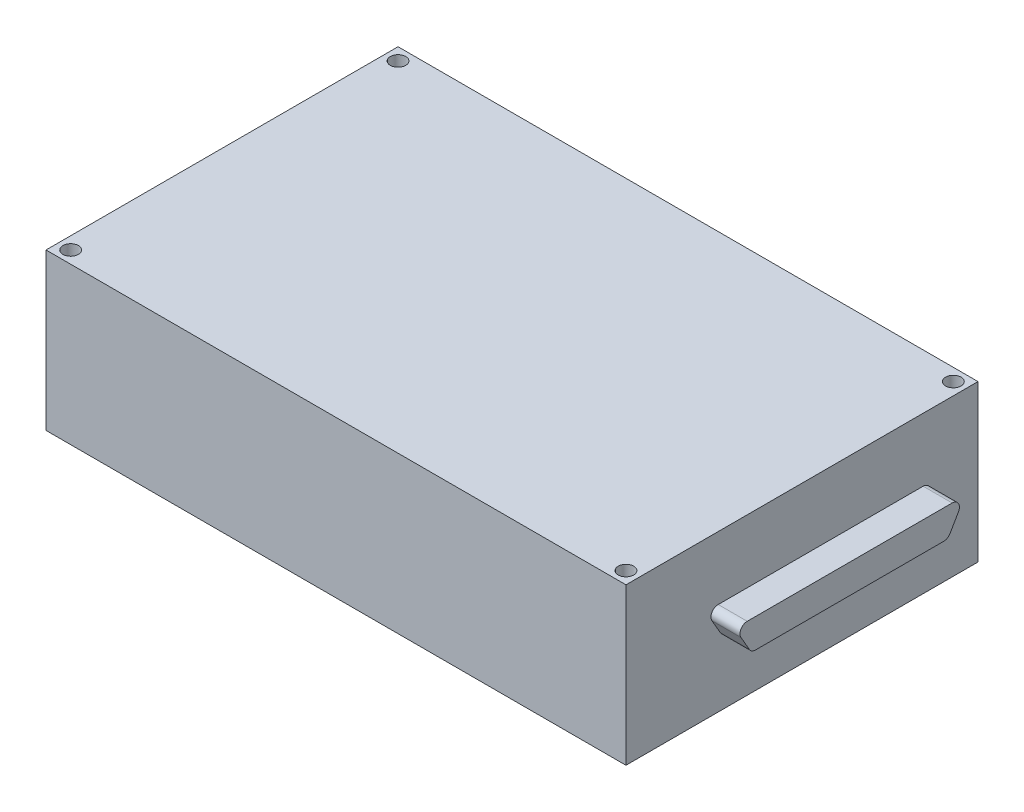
ISO-10303-21;
HEADER;
FILE_DESCRIPTION(('STEP AP214'),'2;1');
FILE_NAME('part.step','',(''),(''),'','','');
FILE_SCHEMA(('AUTOMOTIVE_DESIGN { 1 0 10303 214 1 1 1 1 }'));
ENDSEC;
DATA;
#1=APPLICATION_CONTEXT('core data for automotive mechanical design processes');
#2=APPLICATION_PROTOCOL_DEFINITION('international standard','automotive_design',2000,#1);
#3=PRODUCT_CONTEXT('',#1,'mechanical');
#4=PRODUCT('Part','Part','',(#3));
#5=PRODUCT_RELATED_PRODUCT_CATEGORY('part','',(#4));
#6=PRODUCT_DEFINITION_FORMATION('','',#4);
#7=PRODUCT_DEFINITION_CONTEXT('part definition',#1,'design');
#8=PRODUCT_DEFINITION('design','',#6,#7);
#9=PRODUCT_DEFINITION_SHAPE('','',#8);
#10=(LENGTH_UNIT() NAMED_UNIT(*) SI_UNIT(.MILLI.,.METRE.));
#11=(NAMED_UNIT(*) PLANE_ANGLE_UNIT() SI_UNIT($,.RADIAN.));
#12=(NAMED_UNIT(*) SI_UNIT($,.STERADIAN.) SOLID_ANGLE_UNIT());
#13=UNCERTAINTY_MEASURE_WITH_UNIT(LENGTH_MEASURE(1.E-05),#10,'distance_accuracy_value','');
#14=(GEOMETRIC_REPRESENTATION_CONTEXT(3) GLOBAL_UNCERTAINTY_ASSIGNED_CONTEXT((#13)) GLOBAL_UNIT_ASSIGNED_CONTEXT((#10,
#11,#12)) REPRESENTATION_CONTEXT('',''));
#15=CARTESIAN_POINT('',(0.,0.,0.));
#16=DIRECTION('',(0.,0.,1.));
#17=DIRECTION('',(1.,0.,0.));
#18=AXIS2_PLACEMENT_3D('',#15,#16,#17);
#19=CARTESIAN_POINT('',(-50.8,13.6906,30.8356));
#20=DIRECTION('',(1.,0.,0.));
#21=DIRECTION('',(0.,0.,-1.));
#22=AXIS2_PLACEMENT_3D('',#19,#20,#21);
#23=PLANE('',#22);
#24=CARTESIAN_POINT('',(-50.8,-1.9304,-12.0904));
#25=DIRECTION('',(1.,0.,0.));
#26=DIRECTION('',(0.,0.,-1.));
#27=AXIS2_PLACEMENT_3D('',#24,#25,#26);
#28=CIRCLE('',#27,5.08);
#29=CARTESIAN_POINT('',(-50.8,-1.9304,-17.1704));
#30=VERTEX_POINT('',#29);
#31=EDGE_CURVE('E49',#30,#30,#28,.F.);
#32=ORIENTED_EDGE('',*,*,#31,.F.);
#33=EDGE_LOOP('',(#32));
#34=FACE_BOUND('',#33,.T.);
#35=DIRECTION('',(0.,0.,1.));
#36=VECTOR('',#35,1.);
#37=CARTESIAN_POINT('',(-50.8,-13.6906,30.8356));
#38=LINE('',#37,#36);
#39=CARTESIAN_POINT('',(-50.8,-13.6906,-30.8356));
#40=VERTEX_POINT('',#39);
#41=CARTESIAN_POINT('',(-50.8,-13.6906,30.8356));
#42=VERTEX_POINT('',#41);
#43=EDGE_CURVE('E266',#40,#42,#38,.T.);
#44=ORIENTED_EDGE('',*,*,#43,.T.);
#45=DIRECTION('',(0.,-1.,0.));
#46=VECTOR('',#45,1.);
#47=CARTESIAN_POINT('',(-50.8,13.6906,30.8356));
#48=LINE('',#47,#46);
#49=CARTESIAN_POINT('',(-50.8,13.6906,30.8356));
#50=VERTEX_POINT('',#49);
#51=EDGE_CURVE('E274',#50,#42,#48,.T.);
#52=ORIENTED_EDGE('',*,*,#51,.F.);
#53=DIRECTION('',(0.,0.,1.));
#54=VECTOR('',#53,1.);
#55=CARTESIAN_POINT('',(-50.8,13.6906,30.8356));
#56=LINE('',#55,#54);
#57=CARTESIAN_POINT('',(-50.8,13.6906,-30.8356));
#58=VERTEX_POINT('',#57);
#59=EDGE_CURVE('E253',#58,#50,#56,.T.);
#60=ORIENTED_EDGE('',*,*,#59,.F.);
#61=DIRECTION('',(0.,-1.,0.));
#62=VECTOR('',#61,1.);
#63=CARTESIAN_POINT('',(-50.8,13.6906,-30.8356));
#64=LINE('',#63,#62);
#65=EDGE_CURVE('E278',#58,#40,#64,.T.);
#66=ORIENTED_EDGE('',*,*,#65,.T.);
#67=EDGE_LOOP('',(#44,#52,#60,#66));
#68=FACE_BOUND('',#67,.T.);
#69=CARTESIAN_POINT('',(-50.8,2.1336,22.5298));
#70=DIRECTION('',(1.,0.,0.));
#71=DIRECTION('',(0.,0.,-1.));
#72=AXIS2_PLACEMENT_3D('',#69,#70,#71);
#73=CIRCLE('',#72,1.905);
#74=CARTESIAN_POINT('',(-50.8,2.1336,20.6248));
#75=VERTEX_POINT('',#74);
#76=EDGE_CURVE('E11',#75,#75,#73,.F.);
#77=ORIENTED_EDGE('',*,*,#76,.F.);
#78=EDGE_LOOP('',(#77));
#79=FACE_BOUND('',#78,.T.);
#80=ADVANCED_FACE('F41',(#34,#68,#79),#23,.F.);
#81=CARTESIAN_POINT('',(50.8,13.6906,30.8356));
#82=DIRECTION('',(-1.,0.,0.));
#83=DIRECTION('',(0.,0.,1.));
#84=AXIS2_PLACEMENT_3D('',#81,#82,#83);
#85=PLANE('',#84);
#86=DIRECTION('',(0.,0.,-1.));
#87=VECTOR('',#86,1.);
#88=CARTESIAN_POINT('',(50.8,-13.6906,30.8356));
#89=LINE('',#88,#87);
#90=CARTESIAN_POINT('',(50.8,-13.6906,30.8356));
#91=VERTEX_POINT('',#90);
#92=CARTESIAN_POINT('',(50.8,-13.6906,-30.8356));
#93=VERTEX_POINT('',#92);
#94=EDGE_CURVE('E245',#91,#93,#89,.T.);
#95=ORIENTED_EDGE('',*,*,#94,.T.);
#96=DIRECTION('',(0.,-1.,0.));
#97=VECTOR('',#96,1.);
#98=CARTESIAN_POINT('',(50.8,13.6906,-30.8356));
#99=LINE('',#98,#97);
#100=CARTESIAN_POINT('',(50.8,13.6906,-30.8356));
#101=VERTEX_POINT('',#100);
#102=EDGE_CURVE('E282',#101,#93,#99,.T.);
#103=ORIENTED_EDGE('',*,*,#102,.F.);
#104=DIRECTION('',(0.,0.,-1.));
#105=VECTOR('',#104,1.);
#106=CARTESIAN_POINT('',(50.8,13.6906,30.8356));
#107=LINE('',#106,#105);
#108=CARTESIAN_POINT('',(50.8,13.6906,30.8356));
#109=VERTEX_POINT('',#108);
#110=EDGE_CURVE('E246',#109,#101,#107,.T.);
#111=ORIENTED_EDGE('',*,*,#110,.F.);
#112=DIRECTION('',(0.,-1.,0.));
#113=VECTOR('',#112,1.);
#114=CARTESIAN_POINT('',(50.8,13.6906,30.8356));
#115=LINE('',#114,#113);
#116=EDGE_CURVE('E259',#109,#91,#115,.T.);
#117=ORIENTED_EDGE('',*,*,#116,.T.);
#118=EDGE_LOOP('',(#95,#103,#111,#117));
#119=FACE_BOUND('',#118,.T.);
#120=CARTESIAN_POINT('',(50.8,1.34619999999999,-21.2267477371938));
#121=DIRECTION('',(1.,0.,0.));
#122=DIRECTION('',(0.,0.,1.));
#123=AXIS2_PLACEMENT_3D('',#120,#121,#122);
#124=CIRCLE('',#123,1.27);
#125=CARTESIAN_POINT('',(50.8,0.711199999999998,-22.3266));
#126=VERTEX_POINT('',#125);
#127=CARTESIAN_POINT('',(50.8,2.6162,-21.2267477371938));
#128=VERTEX_POINT('',#127);
#129=EDGE_CURVE('E185',#126,#128,#124,.T.);
#130=ORIENTED_EDGE('',*,*,#129,.F.);
#131=DIRECTION('',(0.,0.86602540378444,-0.499999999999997));
#132=VECTOR('',#131,1.);
#133=CARTESIAN_POINT('',(50.8,0.711199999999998,-22.3266));
#134=LINE('',#133,#132);
#135=CARTESIAN_POINT('',(50.8,-1.8288,-20.8601303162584));
#136=VERTEX_POINT('',#135);
#137=EDGE_CURVE('E190',#136,#126,#134,.T.);
#138=ORIENTED_EDGE('',*,*,#137,.F.);
#139=CARTESIAN_POINT('',(50.8,-1.1938,-19.7602780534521));
#140=DIRECTION('',(1.,0.,0.));
#141=DIRECTION('',(0.,0.,-1.));
#142=AXIS2_PLACEMENT_3D('',#139,#140,#141);
#143=CIRCLE('',#142,1.27);
#144=CARTESIAN_POINT('',(50.8,-2.4638,-19.7602780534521));
#145=VERTEX_POINT('',#144);
#146=EDGE_CURVE('E218',#145,#136,#143,.T.);
#147=ORIENTED_EDGE('',*,*,#146,.F.);
#148=DIRECTION('',(0.,0.,-1.));
#149=VECTOR('',#148,1.);
#150=CARTESIAN_POINT('',(50.8,-2.4638,13.2070780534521));
#151=LINE('',#150,#149);
#152=CARTESIAN_POINT('',(50.8,-2.4638,13.2070780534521));
#153=VERTEX_POINT('',#152);
#154=EDGE_CURVE('E215',#153,#145,#151,.T.);
#155=ORIENTED_EDGE('',*,*,#154,.F.);
#156=CARTESIAN_POINT('',(50.8,-1.1938,13.2070780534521));
#157=DIRECTION('',(1.,0.,0.));
#158=DIRECTION('',(0.,0.,-1.));
#159=AXIS2_PLACEMENT_3D('',#156,#157,#158);
#160=CIRCLE('',#159,1.27);
#161=CARTESIAN_POINT('',(50.8,-1.8288,14.3069303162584));
#162=VERTEX_POINT('',#161);
#163=EDGE_CURVE('E212',#162,#153,#160,.T.);
#164=ORIENTED_EDGE('',*,*,#163,.F.);
#165=DIRECTION('',(0.,-0.86602540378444,-0.499999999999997));
#166=VECTOR('',#165,1.);
#167=CARTESIAN_POINT('',(50.8,0.711199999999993,15.7734));
#168=LINE('',#167,#166);
#169=CARTESIAN_POINT('',(50.8,0.711199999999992,15.7734));
#170=VERTEX_POINT('',#169);
#171=EDGE_CURVE('E209',#170,#162,#168,.T.);
#172=ORIENTED_EDGE('',*,*,#171,.F.);
#173=CARTESIAN_POINT('',(50.8,1.34619999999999,14.6735477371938));
#174=DIRECTION('',(1.,0.,0.));
#175=DIRECTION('',(0.,0.,1.));
#176=AXIS2_PLACEMENT_3D('',#173,#174,#175);
#177=CIRCLE('',#176,1.27);
#178=CARTESIAN_POINT('',(50.8,2.61619999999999,14.6735477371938));
#179=VERTEX_POINT('',#178);
#180=EDGE_CURVE('E61',#179,#170,#177,.T.);
#181=ORIENTED_EDGE('',*,*,#180,.F.);
#182=DIRECTION('',(0.,0.,1.));
#183=VECTOR('',#182,1.);
#184=CARTESIAN_POINT('',(50.8,2.6162,14.6735477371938));
#185=LINE('',#184,#183);
#186=EDGE_CURVE('E56',#128,#179,#185,.T.);
#187=ORIENTED_EDGE('',*,*,#186,.F.);
#188=EDGE_LOOP('',(#130,#138,#147,#155,#164,#172,#181,#187));
#189=FACE_BOUND('',#188,.T.);
#190=ADVANCED_FACE('F43',(#119,#189),#85,.F.);
#191=CARTESIAN_POINT('',(-50.8,13.6906,-30.8356));
#192=DIRECTION('',(0.,0.,1.));
#193=DIRECTION('',(1.,0.,0.));
#194=AXIS2_PLACEMENT_3D('',#191,#192,#193);
#195=PLANE('',#194);
#196=DIRECTION('',(-1.,0.,0.));
#197=VECTOR('',#196,1.);
#198=CARTESIAN_POINT('',(-50.8,-13.6906,-30.8356));
#199=LINE('',#198,#197);
#200=EDGE_CURVE('E263',#93,#40,#199,.T.);
#201=ORIENTED_EDGE('',*,*,#200,.T.);
#202=ORIENTED_EDGE('',*,*,#65,.F.);
#203=DIRECTION('',(-1.,0.,0.));
#204=VECTOR('',#203,1.);
#205=CARTESIAN_POINT('',(-50.8,13.6906,-30.8356));
#206=LINE('',#205,#204);
#207=EDGE_CURVE('E249',#101,#58,#206,.T.);
#208=ORIENTED_EDGE('',*,*,#207,.F.);
#209=ORIENTED_EDGE('',*,*,#102,.T.);
#210=EDGE_LOOP('',(#201,#202,#208,#209));
#211=FACE_BOUND('',#210,.T.);
#212=ADVANCED_FACE('F366',(#211),#195,.F.);
#213=CARTESIAN_POINT('',(-50.8,13.6906,30.8356));
#214=DIRECTION('',(0.,0.,-1.));
#215=DIRECTION('',(-1.,0.,0.));
#216=AXIS2_PLACEMENT_3D('',#213,#214,#215);
#217=PLANE('',#216);
#218=DIRECTION('',(1.,0.,0.));
#219=VECTOR('',#218,1.);
#220=CARTESIAN_POINT('',(-50.8,-13.6906,30.8356));
#221=LINE('',#220,#219);
#222=EDGE_CURVE('E250',#42,#91,#221,.T.);
#223=ORIENTED_EDGE('',*,*,#222,.T.);
#224=ORIENTED_EDGE('',*,*,#116,.F.);
#225=DIRECTION('',(1.,0.,0.));
#226=VECTOR('',#225,1.);
#227=CARTESIAN_POINT('',(-50.8,13.6906,30.8356));
#228=LINE('',#227,#226);
#229=EDGE_CURVE('E256',#50,#109,#228,.T.);
#230=ORIENTED_EDGE('',*,*,#229,.F.);
#231=ORIENTED_EDGE('',*,*,#51,.T.);
#232=EDGE_LOOP('',(#223,#224,#230,#231));
#233=FACE_BOUND('',#232,.T.);
#234=ADVANCED_FACE('F360',(#233),#217,.F.);
#235=CARTESIAN_POINT('',(0.,13.6906,0.));
#236=DIRECTION('',(0.,-1.,0.));
#237=DIRECTION('',(0.,0.,-1.));
#238=AXIS2_PLACEMENT_3D('',#235,#236,#237);
#239=PLANE('',#238);
#240=CARTESIAN_POINT('',(48.641,13.6906,28.6766));
#241=DIRECTION('',(0.,1.,0.));
#242=DIRECTION('',(0.,0.,1.));
#243=AXIS2_PLACEMENT_3D('',#240,#241,#242);
#244=CIRCLE('',#243,1.35254999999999);
#245=CARTESIAN_POINT('',(48.641,13.6906,30.02915));
#246=VERTEX_POINT('',#245);
#247=EDGE_CURVE('E153',#246,#246,#244,.T.);
#248=ORIENTED_EDGE('',*,*,#247,.F.);
#249=EDGE_LOOP('',(#248));
#250=FACE_BOUND('',#249,.T.);
#251=CARTESIAN_POINT('',(-48.641,13.6906,-28.6766));
#252=DIRECTION('',(0.,1.,0.));
#253=DIRECTION('',(0.,0.,1.));
#254=AXIS2_PLACEMENT_3D('',#251,#252,#253);
#255=CIRCLE('',#254,1.35254999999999);
#256=CARTESIAN_POINT('',(-48.641,13.6906,-27.32405));
#257=VERTEX_POINT('',#256);
#258=EDGE_CURVE('E152',#257,#257,#255,.T.);
#259=ORIENTED_EDGE('',*,*,#258,.F.);
#260=EDGE_LOOP('',(#259));
#261=FACE_BOUND('',#260,.T.);
#262=CARTESIAN_POINT('',(48.641,13.6906,-28.6766));
#263=DIRECTION('',(0.,1.,0.));
#264=DIRECTION('',(0.,0.,1.));
#265=AXIS2_PLACEMENT_3D('',#262,#263,#264);
#266=CIRCLE('',#265,1.35254999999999);
#267=CARTESIAN_POINT('',(48.641,13.6906,-27.32405));
#268=VERTEX_POINT('',#267);
#269=EDGE_CURVE('E165',#268,#268,#266,.T.);
#270=ORIENTED_EDGE('',*,*,#269,.F.);
#271=EDGE_LOOP('',(#270));
#272=FACE_BOUND('',#271,.T.);
#273=CARTESIAN_POINT('',(-48.641,13.6906,28.6766));
#274=DIRECTION('',(0.,1.,0.));
#275=DIRECTION('',(0.,0.,1.));
#276=AXIS2_PLACEMENT_3D('',#273,#274,#275);
#277=CIRCLE('',#276,1.35254999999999);
#278=CARTESIAN_POINT('',(-48.641,13.6906,30.02915));
#279=VERTEX_POINT('',#278);
#280=EDGE_CURVE('E171',#279,#279,#277,.T.);
#281=ORIENTED_EDGE('',*,*,#280,.F.);
#282=EDGE_LOOP('',(#281));
#283=FACE_BOUND('',#282,.T.);
#284=ORIENTED_EDGE('',*,*,#110,.T.);
#285=ORIENTED_EDGE('',*,*,#207,.T.);
#286=ORIENTED_EDGE('',*,*,#59,.T.);
#287=ORIENTED_EDGE('',*,*,#229,.T.);
#288=EDGE_LOOP('',(#284,#285,#286,#287));
#289=FACE_BOUND('',#288,.T.);
#290=ADVANCED_FACE('F357',(#250,#261,#272,#283,#289),#239,.F.);
#291=CARTESIAN_POINT('',(0.,-13.6906,0.));
#292=DIRECTION('',(0.,-1.,0.));
#293=DIRECTION('',(0.,0.,-1.));
#294=AXIS2_PLACEMENT_3D('',#291,#292,#293);
#295=PLANE('',#294);
#296=ORIENTED_EDGE('',*,*,#94,.F.);
#297=ORIENTED_EDGE('',*,*,#222,.F.);
#298=ORIENTED_EDGE('',*,*,#43,.F.);
#299=ORIENTED_EDGE('',*,*,#200,.F.);
#300=EDGE_LOOP('',(#296,#297,#298,#299));
#301=FACE_BOUND('',#300,.T.);
#302=ADVANCED_FACE('F355',(#301),#295,.T.);
#303=CARTESIAN_POINT('',(55.88,1.34619999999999,-21.2267477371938));
#304=DIRECTION('',(-1.,0.,0.));
#305=DIRECTION('',(0.,0.,1.));
#306=AXIS2_PLACEMENT_3D('',#303,#304,#305);
#307=CYLINDRICAL_SURFACE('',#306,1.27);
#308=ORIENTED_EDGE('',*,*,#129,.T.);
#309=DIRECTION('',(-1.,0.,0.));
#310=VECTOR('',#309,1.);
#311=CARTESIAN_POINT('',(55.88,2.6162,-21.2267477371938));
#312=LINE('',#311,#310);
#313=CARTESIAN_POINT('',(55.88,2.6162,-21.2267477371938));
#314=VERTEX_POINT('',#313);
#315=EDGE_CURVE('E243',#314,#128,#312,.T.);
#316=ORIENTED_EDGE('',*,*,#315,.F.);
#317=CARTESIAN_POINT('',(55.88,1.34619999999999,-21.2267477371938));
#318=DIRECTION('',(1.,0.,0.));
#319=DIRECTION('',(0.,0.,1.));
#320=AXIS2_PLACEMENT_3D('',#317,#318,#319);
#321=CIRCLE('',#320,1.27);
#322=CARTESIAN_POINT('',(55.88,0.711199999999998,-22.3266));
#323=VERTEX_POINT('',#322);
#324=EDGE_CURVE('E186',#323,#314,#321,.T.);
#325=ORIENTED_EDGE('',*,*,#324,.F.);
#326=DIRECTION('',(-1.,0.,0.));
#327=VECTOR('',#326,1.);
#328=CARTESIAN_POINT('',(55.88,0.711199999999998,-22.3266));
#329=LINE('',#328,#327);
#330=EDGE_CURVE('E204',#323,#126,#329,.T.);
#331=ORIENTED_EDGE('',*,*,#330,.T.);
#332=EDGE_LOOP('',(#308,#316,#325,#331));
#333=FACE_BOUND('',#332,.T.);
#334=ADVANCED_FACE('F351',(#333),#307,.T.);
#335=CARTESIAN_POINT('',(55.88,2.6162,14.6735477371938));
#336=DIRECTION('',(0.,-1.,0.));
#337=DIRECTION('',(0.,0.,-1.));
#338=AXIS2_PLACEMENT_3D('',#335,#336,#337);
#339=PLANE('',#338);
#340=ORIENTED_EDGE('',*,*,#186,.T.);
#341=DIRECTION('',(-1.,0.,0.));
#342=VECTOR('',#341,1.);
#343=CARTESIAN_POINT('',(55.88,2.6162,14.6735477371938));
#344=LINE('',#343,#342);
#345=CARTESIAN_POINT('',(55.88,2.6162,14.6735477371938));
#346=VERTEX_POINT('',#345);
#347=EDGE_CURVE('E240',#346,#179,#344,.T.);
#348=ORIENTED_EDGE('',*,*,#347,.F.);
#349=DIRECTION('',(0.,0.,1.));
#350=VECTOR('',#349,1.);
#351=CARTESIAN_POINT('',(55.88,2.6162,14.6735477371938));
#352=LINE('',#351,#350);
#353=EDGE_CURVE('E189',#314,#346,#352,.T.);
#354=ORIENTED_EDGE('',*,*,#353,.F.);
#355=ORIENTED_EDGE('',*,*,#315,.T.);
#356=EDGE_LOOP('',(#340,#348,#354,#355));
#357=FACE_BOUND('',#356,.T.);
#358=ADVANCED_FACE('F347',(#357),#339,.F.);
#359=CARTESIAN_POINT('',(55.88,1.34619999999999,14.6735477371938));
#360=DIRECTION('',(-1.,0.,0.));
#361=DIRECTION('',(0.,0.,1.));
#362=AXIS2_PLACEMENT_3D('',#359,#360,#361);
#363=CYLINDRICAL_SURFACE('',#362,1.27);
#364=ORIENTED_EDGE('',*,*,#180,.T.);
#365=DIRECTION('',(-1.,0.,0.));
#366=VECTOR('',#365,1.);
#367=CARTESIAN_POINT('',(55.88,0.711199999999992,15.7734));
#368=LINE('',#367,#366);
#369=CARTESIAN_POINT('',(55.88,0.711199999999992,15.7734));
#370=VERTEX_POINT('',#369);
#371=EDGE_CURVE('E237',#370,#170,#368,.T.);
#372=ORIENTED_EDGE('',*,*,#371,.F.);
#373=CARTESIAN_POINT('',(55.88,1.34619999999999,14.6735477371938));
#374=DIRECTION('',(1.,0.,0.));
#375=DIRECTION('',(0.,0.,1.));
#376=AXIS2_PLACEMENT_3D('',#373,#374,#375);
#377=CIRCLE('',#376,1.27);
#378=EDGE_CURVE('E192',#346,#370,#377,.T.);
#379=ORIENTED_EDGE('',*,*,#378,.F.);
#380=ORIENTED_EDGE('',*,*,#347,.T.);
#381=EDGE_LOOP('',(#364,#372,#379,#380));
#382=FACE_BOUND('',#381,.T.);
#383=ADVANCED_FACE('F343',(#382),#363,.T.);
#384=CARTESIAN_POINT('',(55.88,0.711199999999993,15.7734));
#385=DIRECTION('',(0.,0.499999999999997,-0.86602540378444));
#386=DIRECTION('',(0.,0.86602540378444,0.499999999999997));
#387=AXIS2_PLACEMENT_3D('',#384,#385,#386);
#388=PLANE('',#387);
#389=ORIENTED_EDGE('',*,*,#171,.T.);
#390=DIRECTION('',(-1.,0.,0.));
#391=VECTOR('',#390,1.);
#392=CARTESIAN_POINT('',(55.88,-1.8288,14.3069303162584));
#393=LINE('',#392,#391);
#394=CARTESIAN_POINT('',(55.88,-1.8288,14.3069303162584));
#395=VERTEX_POINT('',#394);
#396=EDGE_CURVE('E234',#395,#162,#393,.T.);
#397=ORIENTED_EDGE('',*,*,#396,.F.);
#398=DIRECTION('',(0.,-0.86602540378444,-0.499999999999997));
#399=VECTOR('',#398,1.);
#400=CARTESIAN_POINT('',(55.88,0.711199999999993,15.7734));
#401=LINE('',#400,#399);
#402=EDGE_CURVE('E194',#370,#395,#401,.T.);
#403=ORIENTED_EDGE('',*,*,#402,.F.);
#404=ORIENTED_EDGE('',*,*,#371,.T.);
#405=EDGE_LOOP('',(#389,#397,#403,#404));
#406=FACE_BOUND('',#405,.T.);
#407=ADVANCED_FACE('F339',(#406),#388,.F.);
#408=CARTESIAN_POINT('',(55.88,-1.1938,13.2070780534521));
#409=DIRECTION('',(-1.,0.,0.));
#410=DIRECTION('',(0.,0.,1.));
#411=AXIS2_PLACEMENT_3D('',#408,#409,#410);
#412=CYLINDRICAL_SURFACE('',#411,1.27);
#413=ORIENTED_EDGE('',*,*,#163,.T.);
#414=DIRECTION('',(-1.,0.,0.));
#415=VECTOR('',#414,1.);
#416=CARTESIAN_POINT('',(55.88,-2.4638,13.2070780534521));
#417=LINE('',#416,#415);
#418=CARTESIAN_POINT('',(55.88,-2.4638,13.2070780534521));
#419=VERTEX_POINT('',#418);
#420=EDGE_CURVE('E231',#419,#153,#417,.T.);
#421=ORIENTED_EDGE('',*,*,#420,.F.);
#422=CARTESIAN_POINT('',(55.88,-1.1938,13.2070780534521));
#423=DIRECTION('',(1.,0.,0.));
#424=DIRECTION('',(0.,0.,-1.));
#425=AXIS2_PLACEMENT_3D('',#422,#423,#424);
#426=CIRCLE('',#425,1.27);
#427=EDGE_CURVE('E196',#395,#419,#426,.T.);
#428=ORIENTED_EDGE('',*,*,#427,.F.);
#429=ORIENTED_EDGE('',*,*,#396,.T.);
#430=EDGE_LOOP('',(#413,#421,#428,#429));
#431=FACE_BOUND('',#430,.T.);
#432=ADVANCED_FACE('F335',(#431),#412,.T.);
#433=CARTESIAN_POINT('',(55.88,-2.4638,13.2070780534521));
#434=DIRECTION('',(0.,1.,0.));
#435=DIRECTION('',(0.,0.,1.));
#436=AXIS2_PLACEMENT_3D('',#433,#434,#435);
#437=PLANE('',#436);
#438=ORIENTED_EDGE('',*,*,#154,.T.);
#439=DIRECTION('',(-1.,0.,0.));
#440=VECTOR('',#439,1.);
#441=CARTESIAN_POINT('',(55.88,-2.4638,-19.7602780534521));
#442=LINE('',#441,#440);
#443=CARTESIAN_POINT('',(55.88,-2.4638,-19.7602780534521));
#444=VERTEX_POINT('',#443);
#445=EDGE_CURVE('E228',#444,#145,#442,.T.);
#446=ORIENTED_EDGE('',*,*,#445,.F.);
#447=DIRECTION('',(0.,0.,-1.));
#448=VECTOR('',#447,1.);
#449=CARTESIAN_POINT('',(55.88,-2.4638,13.2070780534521));
#450=LINE('',#449,#448);
#451=EDGE_CURVE('E198',#419,#444,#450,.T.);
#452=ORIENTED_EDGE('',*,*,#451,.F.);
#453=ORIENTED_EDGE('',*,*,#420,.T.);
#454=EDGE_LOOP('',(#438,#446,#452,#453));
#455=FACE_BOUND('',#454,.T.);
#456=ADVANCED_FACE('F331',(#455),#437,.F.);
#457=CARTESIAN_POINT('',(55.88,-1.1938,-19.7602780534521));
#458=DIRECTION('',(-1.,0.,0.));
#459=DIRECTION('',(0.,0.,1.));
#460=AXIS2_PLACEMENT_3D('',#457,#458,#459);
#461=CYLINDRICAL_SURFACE('',#460,1.27);
#462=ORIENTED_EDGE('',*,*,#146,.T.);
#463=DIRECTION('',(-1.,0.,0.));
#464=VECTOR('',#463,1.);
#465=CARTESIAN_POINT('',(55.88,-1.8288,-20.8601303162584));
#466=LINE('',#465,#464);
#467=CARTESIAN_POINT('',(55.88,-1.8288,-20.8601303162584));
#468=VERTEX_POINT('',#467);
#469=EDGE_CURVE('E225',#468,#136,#466,.T.);
#470=ORIENTED_EDGE('',*,*,#469,.F.);
#471=CARTESIAN_POINT('',(55.88,-1.1938,-19.7602780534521));
#472=DIRECTION('',(1.,0.,0.));
#473=DIRECTION('',(0.,0.,-1.));
#474=AXIS2_PLACEMENT_3D('',#471,#472,#473);
#475=CIRCLE('',#474,1.27);
#476=EDGE_CURVE('E200',#444,#468,#475,.T.);
#477=ORIENTED_EDGE('',*,*,#476,.F.);
#478=ORIENTED_EDGE('',*,*,#445,.T.);
#479=EDGE_LOOP('',(#462,#470,#477,#478));
#480=FACE_BOUND('',#479,.T.);
#481=ADVANCED_FACE('F327',(#480),#461,.T.);
#482=CARTESIAN_POINT('',(55.88,0.711199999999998,-22.3266));
#483=DIRECTION('',(0.,0.499999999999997,0.86602540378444));
#484=DIRECTION('',(0.,-0.86602540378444,0.499999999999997));
#485=AXIS2_PLACEMENT_3D('',#482,#483,#484);
#486=PLANE('',#485);
#487=ORIENTED_EDGE('',*,*,#137,.T.);
#488=ORIENTED_EDGE('',*,*,#330,.F.);
#489=DIRECTION('',(0.,0.86602540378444,-0.499999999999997));
#490=VECTOR('',#489,1.);
#491=CARTESIAN_POINT('',(55.88,0.711199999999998,-22.3266));
#492=LINE('',#491,#490);
#493=EDGE_CURVE('E202',#468,#323,#492,.T.);
#494=ORIENTED_EDGE('',*,*,#493,.F.);
#495=ORIENTED_EDGE('',*,*,#469,.T.);
#496=EDGE_LOOP('',(#487,#488,#494,#495));
#497=FACE_BOUND('',#496,.T.);
#498=ADVANCED_FACE('F323',(#497),#486,.F.);
#499=CARTESIAN_POINT('',(55.88,1.34619999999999,-21.2267477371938));
#500=DIRECTION('',(-1.,0.,0.));
#501=DIRECTION('',(0.,0.,1.));
#502=AXIS2_PLACEMENT_3D('',#499,#500,#501);
#503=PLANE('',#502);
#504=ORIENTED_EDGE('',*,*,#324,.T.);
#505=ORIENTED_EDGE('',*,*,#353,.T.);
#506=ORIENTED_EDGE('',*,*,#378,.T.);
#507=ORIENTED_EDGE('',*,*,#402,.T.);
#508=ORIENTED_EDGE('',*,*,#427,.T.);
#509=ORIENTED_EDGE('',*,*,#451,.T.);
#510=ORIENTED_EDGE('',*,*,#476,.T.);
#511=ORIENTED_EDGE('',*,*,#493,.T.);
#512=EDGE_LOOP('',(#504,#505,#506,#507,#508,#509,#510,#511));
#513=FACE_BOUND('',#512,.T.);
#514=ADVANCED_FACE('F319',(#513),#503,.F.);
#515=CARTESIAN_POINT('',(-55.88,-1.9304,-12.0904));
#516=DIRECTION('',(1.,0.,0.));
#517=DIRECTION('',(0.,0.,-1.));
#518=AXIS2_PLACEMENT_3D('',#515,#516,#517);
#519=CYLINDRICAL_SURFACE('',#518,5.08);
#520=CARTESIAN_POINT('',(-55.88,-1.9304,-12.0904));
#521=DIRECTION('',(-1.,0.,0.));
#522=DIRECTION('',(0.,0.,1.));
#523=AXIS2_PLACEMENT_3D('',#520,#521,#522);
#524=CIRCLE('',#523,5.08);
#525=CARTESIAN_POINT('',(-55.88,-1.9304,-7.0104));
#526=VERTEX_POINT('',#525);
#527=EDGE_CURVE('E181',#526,#526,#524,.T.);
#528=ORIENTED_EDGE('',*,*,#527,.F.);
#529=EDGE_LOOP('',(#528));
#530=FACE_BOUND('',#529,.T.);
#531=ORIENTED_EDGE('',*,*,#31,.T.);
#532=EDGE_LOOP('',(#531));
#533=FACE_BOUND('',#532,.T.);
#534=ADVANCED_FACE('F289',(#530,#533),#519,.T.);
#535=CARTESIAN_POINT('',(-55.88,-1.9304,-12.0904));
#536=DIRECTION('',(-1.,0.,0.));
#537=DIRECTION('',(0.,0.,1.));
#538=AXIS2_PLACEMENT_3D('',#535,#536,#537);
#539=PLANE('',#538);
#540=ORIENTED_EDGE('',*,*,#527,.T.);
#541=EDGE_LOOP('',(#540));
#542=FACE_BOUND('',#541,.T.);
#543=ADVANCED_FACE('F302',(#542),#539,.T.);
#544=CARTESIAN_POINT('',(-54.61,2.1336,22.5298));
#545=DIRECTION('',(1.,0.,0.));
#546=DIRECTION('',(0.,0.,-1.));
#547=AXIS2_PLACEMENT_3D('',#544,#545,#546);
#548=CYLINDRICAL_SURFACE('',#547,1.905);
#549=CARTESIAN_POINT('',(-54.61,2.1336,22.5298));
#550=DIRECTION('',(-1.,0.,0.));
#551=DIRECTION('',(0.,0.,1.));
#552=AXIS2_PLACEMENT_3D('',#549,#550,#551);
#553=CIRCLE('',#552,1.905);
#554=CARTESIAN_POINT('',(-54.61,2.1336,20.6248));
#555=VERTEX_POINT('',#554);
#556=EDGE_CURVE('E178',#555,#555,#553,.T.);
#557=CARTESIAN_POINT('',(-54.61,2.1336,20.6248));
#558=CARTESIAN_POINT('',(-54.5703125,2.1336,20.6248));
#559=CARTESIAN_POINT('',(-54.530625,2.1336,20.6248));
#560=CARTESIAN_POINT('',(-54.45125,2.1336,20.6248));
#561=CARTESIAN_POINT('',(-54.4115625,2.1336,20.6248));
#562=CARTESIAN_POINT('',(-54.3321875,2.1336,20.6248));
#563=CARTESIAN_POINT('',(-54.2925,2.1336,20.6248));
#564=CARTESIAN_POINT('',(-54.213125,2.1336,20.6248));
#565=CARTESIAN_POINT('',(-54.1734375,2.1336,20.6248));
#566=CARTESIAN_POINT('',(-54.0940625,2.1336,20.6248));
#567=CARTESIAN_POINT('',(-54.054375,2.1336,20.6248));
#568=CARTESIAN_POINT('',(-53.975,2.1336,20.6248));
#569=CARTESIAN_POINT('',(-53.9353125,2.1336,20.6248));
#570=CARTESIAN_POINT('',(-53.8559375,2.1336,20.6248));
#571=CARTESIAN_POINT('',(-53.81625,2.1336,20.6248));
#572=CARTESIAN_POINT('',(-53.736875,2.1336,20.6248));
#573=CARTESIAN_POINT('',(-53.6971875,2.1336,20.6248));
#574=CARTESIAN_POINT('',(-53.6178125,2.1336,20.6248));
#575=CARTESIAN_POINT('',(-53.578125,2.1336,20.6248));
#576=CARTESIAN_POINT('',(-53.49875,2.1336,20.6248));
#577=CARTESIAN_POINT('',(-53.4590625,2.1336,20.6248));
#578=CARTESIAN_POINT('',(-53.3796875,2.1336,20.6248));
#579=CARTESIAN_POINT('',(-53.34,2.1336,20.6248));
#580=CARTESIAN_POINT('',(-53.260625,2.1336,20.6248));
#581=CARTESIAN_POINT('',(-53.2209375,2.1336,20.6248));
#582=CARTESIAN_POINT('',(-53.1415625,2.1336,20.6248));
#583=CARTESIAN_POINT('',(-53.101875,2.1336,20.6248));
#584=CARTESIAN_POINT('',(-53.0225,2.1336,20.6248));
#585=CARTESIAN_POINT('',(-52.9828125,2.1336,20.6248));
#586=CARTESIAN_POINT('',(-52.9034375,2.1336,20.6248));
#587=CARTESIAN_POINT('',(-52.86375,2.1336,20.6248));
#588=CARTESIAN_POINT('',(-52.784375,2.1336,20.6248));
#589=CARTESIAN_POINT('',(-52.7446875,2.1336,20.6248));
#590=CARTESIAN_POINT('',(-52.6653125,2.1336,20.6248));
#591=CARTESIAN_POINT('',(-52.625625,2.1336,20.6248));
#592=CARTESIAN_POINT('',(-52.54625,2.1336,20.6248));
#593=CARTESIAN_POINT('',(-52.5065625,2.1336,20.6248));
#594=CARTESIAN_POINT('',(-52.4271875,2.1336,20.6248));
#595=CARTESIAN_POINT('',(-52.3875,2.1336,20.6248));
#596=CARTESIAN_POINT('',(-52.308125,2.1336,20.6248));
#597=CARTESIAN_POINT('',(-52.2684375,2.1336,20.6248));
#598=CARTESIAN_POINT('',(-52.1890625,2.1336,20.6248));
#599=CARTESIAN_POINT('',(-52.149375,2.1336,20.6248));
#600=CARTESIAN_POINT('',(-52.07,2.1336,20.6248));
#601=CARTESIAN_POINT('',(-52.0303125,2.1336,20.6248));
#602=CARTESIAN_POINT('',(-51.9509375,2.1336,20.6248));
#603=CARTESIAN_POINT('',(-51.91125,2.1336,20.6248));
#604=CARTESIAN_POINT('',(-51.831875,2.1336,20.6248));
#605=CARTESIAN_POINT('',(-51.7921875,2.1336,20.6248));
#606=CARTESIAN_POINT('',(-51.7128125,2.1336,20.6248));
#607=CARTESIAN_POINT('',(-51.673125,2.1336,20.6248));
#608=CARTESIAN_POINT('',(-51.59375,2.1336,20.6248));
#609=CARTESIAN_POINT('',(-51.5540625,2.1336,20.6248));
#610=CARTESIAN_POINT('',(-51.4746875,2.1336,20.6248));
#611=CARTESIAN_POINT('',(-51.435,2.1336,20.6248));
#612=CARTESIAN_POINT('',(-51.355625,2.1336,20.6248));
#613=CARTESIAN_POINT('',(-51.3159375,2.1336,20.6248));
#614=CARTESIAN_POINT('',(-51.2365625,2.1336,20.6248));
#615=CARTESIAN_POINT('',(-51.196875,2.1336,20.6248));
#616=CARTESIAN_POINT('',(-51.1175,2.1336,20.6248));
#617=CARTESIAN_POINT('',(-51.0778125,2.1336,20.6248));
#618=CARTESIAN_POINT('',(-50.9984375,2.1336,20.6248));
#619=CARTESIAN_POINT('',(-50.95875,2.1336,20.6248));
#620=CARTESIAN_POINT('',(-50.879375,2.1336,20.6248));
#621=CARTESIAN_POINT('',(-50.8396875,2.1336,20.6248));
#622=CARTESIAN_POINT('',(-50.8,2.1336,20.6248));
#623=B_SPLINE_CURVE_WITH_KNOTS('',3,(#557,#558,#559,#560,#561,#562,#563,#564,#565,#566,#567,
#568,#569,#570,#571,#572,#573,#574,#575,#576,#577,#578,#579,#580,#581,#582,#583,#584,#585,#586,
#587,#588,#589,#590,#591,#592,#593,#594,#595,#596,#597,#598,#599,#600,#601,#602,#603,#604,#605,
#606,#607,#608,#609,#610,#611,#612,#613,#614,#615,#616,#617,#618,#619,#620,#621,#622),
.UNSPECIFIED.,.F.,.F.,(4,2,2,2,2,2,2,2,2,2,2,2,2,2,2,2,2,2,2,2,2,2,2,2,2,2,2,2,2,2,2,2,4),(0.,
0.119062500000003,0.238125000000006,0.357187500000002,0.476250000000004,0.5953125,
0.714375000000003,0.833437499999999,0.952500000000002,1.0715625,1.190625,1.3096875,1.42875,
1.5478125,1.666875,1.7859375,1.905,2.0240625,2.143125,2.2621875,2.38125,2.5003125,2.619375,
2.7384375,2.8575,2.97656249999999,3.095625,3.2146875,3.33375,3.4528125,3.571875,3.6909375,
3.80999999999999),.UNSPECIFIED.);
#624=EDGE_CURVE('BSEAM299',#555,#75,#623,.T.);
#625=ORIENTED_EDGE('',*,*,#556,.F.);
#626=ORIENTED_EDGE('',*,*,#76,.T.);
#627=ORIENTED_EDGE('',*,*,#624,.T.);
#628=ORIENTED_EDGE('',*,*,#624,.F.);
#629=EDGE_LOOP('',(#625,#627,#626,#628));
#630=FACE_BOUND('',#629,.T.);
#631=ADVANCED_FACE('F299',(#630),#548,.T.);
#632=CARTESIAN_POINT('',(-54.61,2.1336,22.5298));
#633=DIRECTION('',(-1.,0.,0.));
#634=DIRECTION('',(0.,0.,1.));
#635=AXIS2_PLACEMENT_3D('',#632,#633,#634);
#636=PLANE('',#635);
#637=ORIENTED_EDGE('',*,*,#556,.T.);
#638=EDGE_LOOP('',(#637));
#639=FACE_BOUND('',#638,.T.);
#640=ADVANCED_FACE('F301',(#639),#636,.T.);
#641=CARTESIAN_POINT('',(-48.641,7.3406,28.6766));
#642=DIRECTION('',(0.,1.,0.));
#643=DIRECTION('',(0.,0.,1.));
#644=AXIS2_PLACEMENT_3D('',#641,#642,#643);
#645=CONICAL_SURFACE('',#644,1.35255,1.02974425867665);
#646=CARTESIAN_POINT('',(-48.641,6.52790596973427,28.6766));
#647=VERTEX_POINT('',#646);
#648=VERTEX_LOOP('',#647);
#649=FACE_BOUND('',#648,.T.);
#650=CARTESIAN_POINT('',(-48.641,7.3406,28.6766));
#651=DIRECTION('',(0.,1.,0.));
#652=DIRECTION('',(0.,0.,1.));
#653=AXIS2_PLACEMENT_3D('',#650,#651,#652);
#654=CIRCLE('',#653,1.35255);
#655=CARTESIAN_POINT('',(-48.641,7.3406,30.02915));
#656=VERTEX_POINT('',#655);
#657=EDGE_CURVE('E175',#656,#656,#654,.T.);
#658=ORIENTED_EDGE('',*,*,#657,.T.);
#659=EDGE_LOOP('',(#658));
#660=FACE_BOUND('',#659,.T.);
#661=ADVANCED_FACE('F309',(#649,#660),#645,.F.);
#662=CARTESIAN_POINT('',(-48.641,13.6906,28.6766));
#663=DIRECTION('',(0.,1.,0.));
#664=DIRECTION('',(0.,0.,1.));
#665=AXIS2_PLACEMENT_3D('',#662,#663,#664);
#666=CYLINDRICAL_SURFACE('',#665,1.35254999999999);
#667=ORIENTED_EDGE('',*,*,#657,.F.);
#668=EDGE_LOOP('',(#667));
#669=FACE_BOUND('',#668,.T.);
#670=ORIENTED_EDGE('',*,*,#280,.T.);
#671=EDGE_LOOP('',(#670));
#672=FACE_BOUND('',#671,.T.);
#673=ADVANCED_FACE('F486',(#669,#672),#666,.F.);
#674=CARTESIAN_POINT('',(48.641,7.3406,-28.6766));
#675=DIRECTION('',(0.,1.,0.));
#676=DIRECTION('',(0.,0.,1.));
#677=AXIS2_PLACEMENT_3D('',#674,#675,#676);
#678=CONICAL_SURFACE('',#677,1.35255,1.02974425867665);
#679=CARTESIAN_POINT('',(48.641,6.52790596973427,-28.6766));
#680=VERTEX_POINT('',#679);
#681=VERTEX_LOOP('',#680);
#682=FACE_BOUND('',#681,.T.);
#683=CARTESIAN_POINT('',(48.641,7.3406,-28.6766));
#684=DIRECTION('',(0.,1.,0.));
#685=DIRECTION('',(0.,0.,1.));
#686=AXIS2_PLACEMENT_3D('',#683,#684,#685);
#687=CIRCLE('',#686,1.35255);
#688=CARTESIAN_POINT('',(48.641,7.3406,-27.32405));
#689=VERTEX_POINT('',#688);
#690=EDGE_CURVE('E168',#689,#689,#687,.T.);
#691=ORIENTED_EDGE('',*,*,#690,.T.);
#692=EDGE_LOOP('',(#691));
#693=FACE_BOUND('',#692,.T.);
#694=ADVANCED_FACE('F494',(#682,#693),#678,.F.);
#695=CARTESIAN_POINT('',(48.641,13.6906,-28.6766));
#696=DIRECTION('',(0.,1.,0.));
#697=DIRECTION('',(0.,0.,1.));
#698=AXIS2_PLACEMENT_3D('',#695,#696,#697);
#699=CYLINDRICAL_SURFACE('',#698,1.35254999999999);
#700=ORIENTED_EDGE('',*,*,#690,.F.);
#701=EDGE_LOOP('',(#700));
#702=FACE_BOUND('',#701,.T.);
#703=ORIENTED_EDGE('',*,*,#269,.T.);
#704=EDGE_LOOP('',(#703));
#705=FACE_BOUND('',#704,.T.);
#706=ADVANCED_FACE('F503',(#702,#705),#699,.F.);
#707=CARTESIAN_POINT('',(-48.641,7.3406,-28.6766));
#708=DIRECTION('',(0.,1.,0.));
#709=DIRECTION('',(0.,0.,1.));
#710=AXIS2_PLACEMENT_3D('',#707,#708,#709);
#711=CONICAL_SURFACE('',#710,1.35255,1.02974425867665);
#712=CARTESIAN_POINT('',(-48.641,6.52790596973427,-28.6766));
#713=VERTEX_POINT('',#712);
#714=VERTEX_LOOP('',#713);
#715=FACE_BOUND('',#714,.T.);
#716=CARTESIAN_POINT('',(-48.641,7.3406,-28.6766));
#717=DIRECTION('',(0.,1.,0.));
#718=DIRECTION('',(0.,0.,1.));
#719=AXIS2_PLACEMENT_3D('',#716,#717,#718);
#720=CIRCLE('',#719,1.35255);
#721=CARTESIAN_POINT('',(-48.641,7.3406,-27.32405));
#722=VERTEX_POINT('',#721);
#723=EDGE_CURVE('E157',#722,#722,#720,.T.);
#724=ORIENTED_EDGE('',*,*,#723,.T.);
#725=EDGE_LOOP('',(#724));
#726=FACE_BOUND('',#725,.T.);
#727=ADVANCED_FACE('F512',(#715,#726),#711,.F.);
#728=CARTESIAN_POINT('',(-48.641,13.6906,-28.6766));
#729=DIRECTION('',(0.,1.,0.));
#730=DIRECTION('',(0.,0.,1.));
#731=AXIS2_PLACEMENT_3D('',#728,#729,#730);
#732=CYLINDRICAL_SURFACE('',#731,1.35254999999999);
#733=ORIENTED_EDGE('',*,*,#723,.F.);
#734=EDGE_LOOP('',(#733));
#735=FACE_BOUND('',#734,.T.);
#736=ORIENTED_EDGE('',*,*,#258,.T.);
#737=EDGE_LOOP('',(#736));
#738=FACE_BOUND('',#737,.T.);
#739=ADVANCED_FACE('F146',(#735,#738),#732,.F.);
#740=CARTESIAN_POINT('',(48.641,7.3406,28.6766));
#741=DIRECTION('',(0.,1.,0.));
#742=DIRECTION('',(0.,0.,1.));
#743=AXIS2_PLACEMENT_3D('',#740,#741,#742);
#744=CONICAL_SURFACE('',#743,1.35255,1.02974425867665);
#745=CARTESIAN_POINT('',(48.641,6.52790596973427,28.6766));
#746=VERTEX_POINT('',#745);
#747=VERTEX_LOOP('',#746);
#748=FACE_BOUND('',#747,.T.);
#749=CARTESIAN_POINT('',(48.641,7.3406,28.6766));
#750=DIRECTION('',(0.,1.,0.));
#751=DIRECTION('',(0.,0.,1.));
#752=AXIS2_PLACEMENT_3D('',#749,#750,#751);
#753=CIRCLE('',#752,1.35255);
#754=CARTESIAN_POINT('',(48.641,7.3406,30.02915));
#755=VERTEX_POINT('',#754);
#756=EDGE_CURVE('E150',#755,#755,#753,.T.);
#757=ORIENTED_EDGE('',*,*,#756,.T.);
#758=EDGE_LOOP('',(#757));
#759=FACE_BOUND('',#758,.T.);
#760=ADVANCED_FACE('F142',(#748,#759),#744,.F.);
#761=CARTESIAN_POINT('',(48.641,13.6906,28.6766));
#762=DIRECTION('',(0.,1.,0.));
#763=DIRECTION('',(0.,0.,1.));
#764=AXIS2_PLACEMENT_3D('',#761,#762,#763);
#765=CYLINDRICAL_SURFACE('',#764,1.35254999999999);
#766=ORIENTED_EDGE('',*,*,#756,.F.);
#767=EDGE_LOOP('',(#766));
#768=FACE_BOUND('',#767,.T.);
#769=ORIENTED_EDGE('',*,*,#247,.T.);
#770=EDGE_LOOP('',(#769));
#771=FACE_BOUND('',#770,.T.);
#772=ADVANCED_FACE('F145',(#768,#771),#765,.F.);
#773=CLOSED_SHELL('',(#80,#190,#212,#234,#290,#302,#334,#358,#383,#407,#432,#456,#481,#498,#514,
#534,#543,#631,#640,#661,#673,#694,#706,#727,#739,#760,#772));
#774=MANIFOLD_SOLID_BREP('B2',#773);
#775=ADVANCED_BREP_SHAPE_REPRESENTATION('',(#18,#774),#14);
#776=SHAPE_DEFINITION_REPRESENTATION(#9,#775);
ENDSEC;
END-ISO-10303-21;
